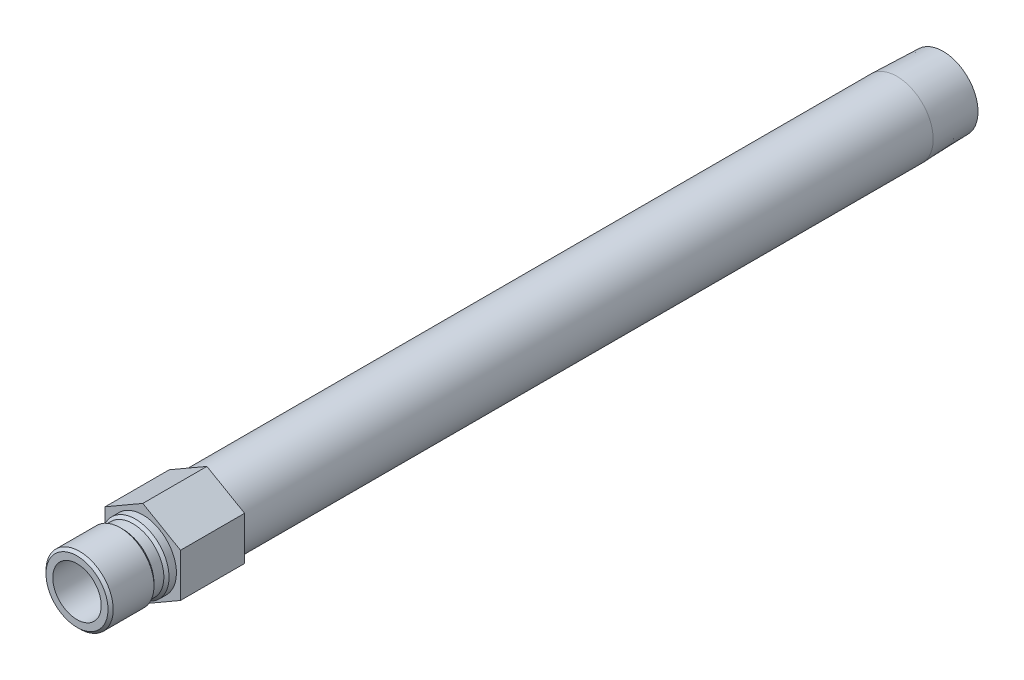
from build123d import *

# Parameters (mm, degrees)
SKETCH2_R           = 7.112
BOSS_EXTRUDE1_DEPTH = 18.796


with BuildPart() as part:
    # Sketch1 → Revolve1 (revolve)
    with BuildSketch(Plane(origin=(0, 0, 0), x_dir=(0, 0, -1), z_dir=(1, 0, 0))):
        Polygon((-19.304, 7.112), (-19.304, 9.0932), (-18.542, 9.8552), (-6.5786, 9.8552), (-5.8166, 9.0932), (-2.921, 9.0932), (-2.159, 9.8552), (0, 9.8552), (0, 10.668), (221.1324, 10.668), (234.696, 10.244140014), (234.696, 7.8994), (-1.105331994, 7.8994), (-1.524, 7.112), align=None)
    revolve(axis=Axis((0, 0, 0), (0, 0, 1)))

    # Sketch2 → Boss-Extrude1 (add)
    with BuildSketch(Plane.XY):
        Polygon((-11.049, 6.379143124), (-11.049, -6.379143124), (0, -12.758286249), (11.049, -6.379143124), (11.049, 6.379143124), (0, 12.758286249), align=None)
        with Locations(Location((0, 0, 0), (0, 0, 90))):
            Circle(SKETCH2_R, mode=Mode.SUBTRACT)
    extrude(amount=-BOSS_EXTRUDE1_DEPTH)


solid = part.part
